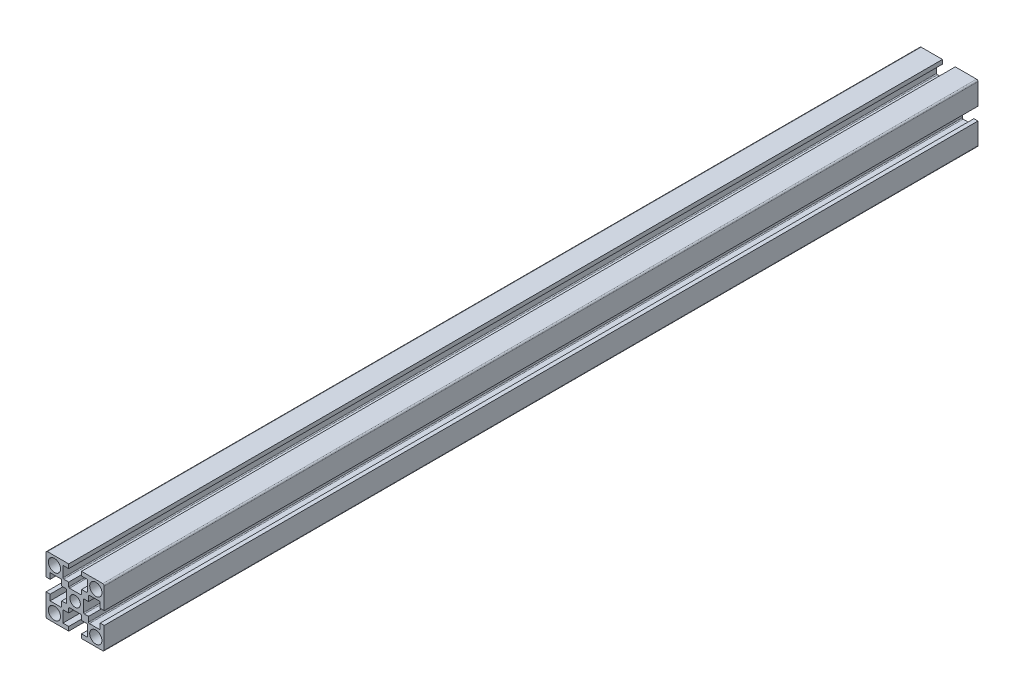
from build123d import *

# Parameters (mm, degrees)
SKETCH_1_R      = 2.1
SKETCH_1_R_2    = 1.8
EXTRUDE_1_DEPTH = 150


with BuildPart() as part:
    # Sketch 1 → Extrude 1 (new, symmetric)
    with BuildSketch(Plane.XY):
        with BuildLine():
            Line((2.2, -3.2), (2.2, -4.6))
            Line((2.2, -4.6), (3.9, -4.6))
            ThreePointArc((3.9, -4.6), (4.112132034, -4.687867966), (4.2, -4.9))
            Line((4.2, -4.9), (4.2, -8.6))
            Line((4.2, -8.6), (2.2, -8.6))
            Line((2.2, -8.6), (2.2, -10))
            Line((2.2, -10), (9.5, -10))
            ThreePointArc((9.5, -10), (9.853553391, -9.853553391), (10, -9.5))
            Line((10, -9.5), (10, -2.2))
            Line((10, -2.2), (8.6, -2.2))
            Line((8.6, -2.2), (8.6, -4.2))
            Line((8.6, -4.2), (4.9, -4.2))
            ThreePointArc((4.9, -4.2), (4.687867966, -4.112132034), (4.6, -3.9))
            Line((4.6, -3.9), (4.6, -2.2))
            Line((4.6, -2.2), (3.2, -2.2))
            ThreePointArc((3.2, -2.2), (2.987867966, -2.112132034), (2.9, -1.9))
            Line((2.9, -1.9), (2.9, 1.9))
            ThreePointArc((2.9, 1.9), (2.987867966, 2.112132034), (3.2, 2.2))
            Line((3.2, 2.2), (4.6, 2.2))
            Line((4.6, 2.2), (4.6, 3.9))
            ThreePointArc((4.6, 3.9), (4.687867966, 4.112132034), (4.9, 4.2))
            Line((4.9, 4.2), (8.6, 4.2))
            Line((8.6, 4.2), (8.6, 2.2))
            Line((8.6, 2.2), (10, 2.2))
            Line((10, 2.2), (10, 9.5))
            ThreePointArc((10, 9.5), (9.853553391, 9.853553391), (9.5, 10))
            Line((9.5, 10), (2.2, 10))
            Line((2.2, 10), (2.2, 8.6))
            Line((2.2, 8.6), (4.2, 8.6))
            Line((4.2, 8.6), (4.2, 4.9))
            ThreePointArc((4.2, 4.9), (4.112132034, 4.687867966), (3.9, 4.6))
            Line((3.9, 4.6), (2.2, 4.6))
            Line((2.2, 4.6), (2.2, 3.2))
            ThreePointArc((2.2, 3.2), (2.112132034, 2.987867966), (1.9, 2.9))
            Line((1.9, 2.9), (-1.9, 2.9))
            ThreePointArc((-1.9, 2.9), (-2.112132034, 2.987867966), (-2.2, 3.2))
            Line((-2.2, 3.2), (-2.2, 4.6))
            Line((-2.2, 4.6), (-3.9, 4.6))
            ThreePointArc((-3.9, 4.6), (-4.112132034, 4.687867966), (-4.2, 4.9))
            Line((-4.2, 4.9), (-4.2, 8.6))
            Line((-4.2, 8.6), (-2.2, 8.6))
            Line((-2.2, 8.6), (-2.2, 10))
            Line((-2.2, 10), (-9.5, 10))
            ThreePointArc((-9.5, 10), (-9.853553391, 9.853553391), (-10, 9.5))
            Line((-10, 9.5), (-10, 2.2))
            Line((-10, 2.2), (-8.6, 2.2))
            Line((-8.6, 2.2), (-8.6, 4.2))
            Line((-8.6, 4.2), (-4.9, 4.2))
            ThreePointArc((-4.9, 4.2), (-4.687867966, 4.112132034), (-4.6, 3.9))
            Line((-4.6, 3.9), (-4.6, 2.2))
            Line((-4.6, 2.2), (-3.2, 2.2))
            ThreePointArc((-3.2, 2.2), (-2.987867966, 2.112132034), (-2.9, 1.9))
            Line((-2.9, 1.9), (-2.9, -1.9))
            ThreePointArc((-2.9, -1.9), (-2.987867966, -2.112132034), (-3.2, -2.2))
            Line((-3.2, -2.2), (-4.6, -2.2))
            Line((-4.6, -2.2), (-4.6, -3.9))
            ThreePointArc((-4.6, -3.9), (-4.687867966, -4.112132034), (-4.9, -4.2))
            Line((-4.9, -4.2), (-8.6, -4.2))
            Line((-8.6, -4.2), (-8.6, -2.2))
            Line((-8.6, -2.2), (-10, -2.2))
            Line((-10, -2.2), (-10, -9.5))
            ThreePointArc((-10, -9.5), (-9.853553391, -9.853553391), (-9.5, -10))
            Line((-9.5, -10), (-2.2, -10))
            Line((-2.2, -10), (-2.2, -8.6))
            Line((-2.2, -8.6), (-4.2, -8.6))
            Line((-4.2, -8.6), (-4.2, -4.9))
            ThreePointArc((-4.2, -4.9), (-4.112132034, -4.687867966), (-3.9, -4.6))
            Line((-3.9, -4.6), (-2.2, -4.6))
            Line((-2.2, -4.6), (-2.2, -3.2))
            ThreePointArc((-2.2, -3.2), (-2.112132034, -2.987867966), (-1.9, -2.9))
            Line((-1.9, -2.9), (1.9, -2.9))
            ThreePointArc((1.9, -2.9), (2.112132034, -2.987867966), (2.2, -3.2))
        make_face()
        with Locations((7.1, 7.1)):
            Circle(SKETCH_1_R, mode=Mode.SUBTRACT)
        with Locations((7.1, -7.1)):
            Circle(SKETCH_1_R, mode=Mode.SUBTRACT)
        Circle(SKETCH_1_R_2, mode=Mode.SUBTRACT)
        with Locations((-7.1, -7.1)):
            Circle(SKETCH_1_R, mode=Mode.SUBTRACT)
        with Locations((-7.1, 7.1)):
            Circle(SKETCH_1_R, mode=Mode.SUBTRACT)
    extrude(amount=EXTRUDE_1_DEPTH, both=True)


solid = part.part
